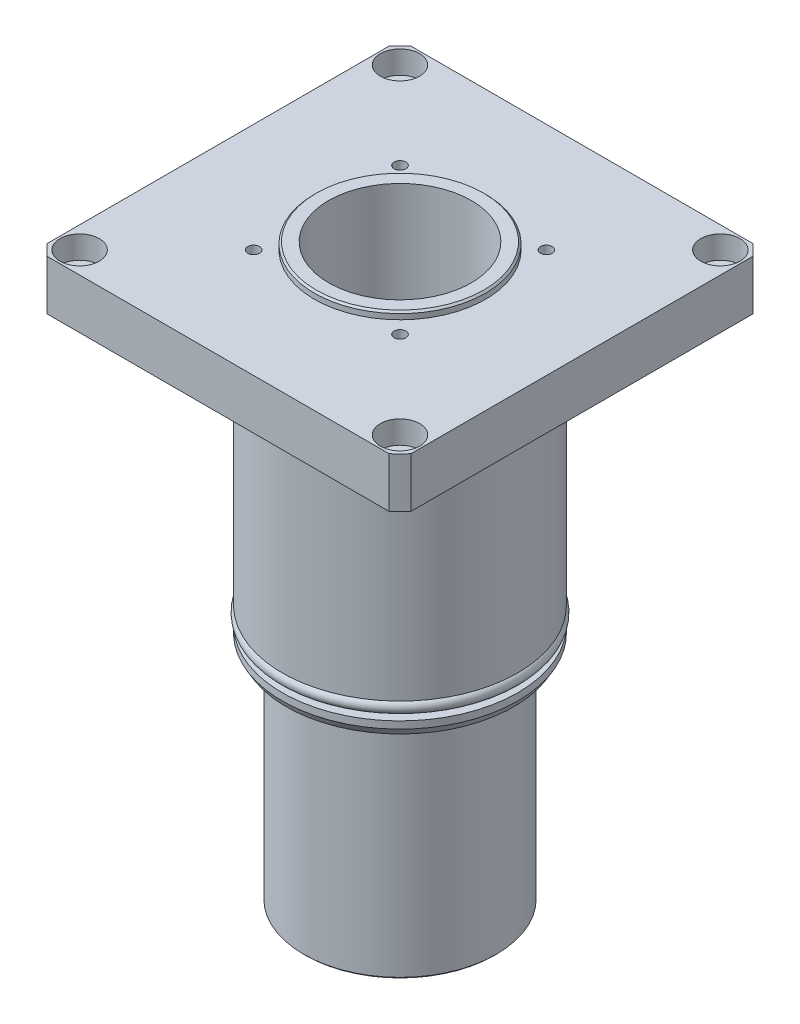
ISO-10303-21;
HEADER;
FILE_DESCRIPTION(('STEP AP214'),'2;1');
FILE_NAME('part.step','',(''),(''),'','','');
FILE_SCHEMA(('AUTOMOTIVE_DESIGN { 1 0 10303 214 1 1 1 1 }'));
ENDSEC;
DATA;
#1=APPLICATION_CONTEXT('core data for automotive mechanical design processes');
#2=APPLICATION_PROTOCOL_DEFINITION('international standard','automotive_design',2000,#1);
#3=PRODUCT_CONTEXT('',#1,'mechanical');
#4=PRODUCT('Part','Part','',(#3));
#5=PRODUCT_RELATED_PRODUCT_CATEGORY('part','',(#4));
#6=PRODUCT_DEFINITION_FORMATION('','',#4);
#7=PRODUCT_DEFINITION_CONTEXT('part definition',#1,'design');
#8=PRODUCT_DEFINITION('design','',#6,#7);
#9=PRODUCT_DEFINITION_SHAPE('','',#8);
#10=(LENGTH_UNIT() NAMED_UNIT(*) SI_UNIT(.MILLI.,.METRE.));
#11=(NAMED_UNIT(*) PLANE_ANGLE_UNIT() SI_UNIT($,.RADIAN.));
#12=(NAMED_UNIT(*) SI_UNIT($,.STERADIAN.) SOLID_ANGLE_UNIT());
#13=UNCERTAINTY_MEASURE_WITH_UNIT(LENGTH_MEASURE(1.E-05),#10,'distance_accuracy_value','');
#14=(GEOMETRIC_REPRESENTATION_CONTEXT(3) GLOBAL_UNCERTAINTY_ASSIGNED_CONTEXT((#13)) GLOBAL_UNIT_ASSIGNED_CONTEXT((#10,
#11,#12)) REPRESENTATION_CONTEXT('',''));
#15=CARTESIAN_POINT('',(0.,0.,0.));
#16=DIRECTION('',(0.,0.,1.));
#17=DIRECTION('',(1.,0.,0.));
#18=AXIS2_PLACEMENT_3D('',#15,#16,#17);
#19=CARTESIAN_POINT('',(0.,7.03500000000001,0.));
#20=DIRECTION('',(0.,1.,0.));
#21=DIRECTION('',(-1.,0.,0.));
#22=AXIS2_PLACEMENT_3D('',#19,#20,#21);
#23=TOROIDAL_SURFACE('',#22,31.725,1.76500000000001);
#24=CARTESIAN_POINT('',(-33.49,7.03500000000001,0.));
#25=VERTEX_POINT('',#24);
#26=VERTEX_LOOP('',#25);
#27=FACE_BOUND('',#26,.T.);
#28=ADVANCED_FACE('F44',(#27),#23,.T.);
#29=CLOSED_SHELL('',(#28));
#30=MANIFOLD_SOLID_BREP('B2',#29);
#31=CARTESIAN_POINT('',(70.,95.,0.));
#32=DIRECTION('',(0.,-1.,0.));
#33=DIRECTION('',(1.,0.,0.));
#34=AXIS2_PLACEMENT_3D('',#31,#32,#33);
#35=PLANE('',#34);
#36=CARTESIAN_POINT('',(20.5060966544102,95.,20.5060966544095));
#37=DIRECTION('',(0.,1.,0.));
#38=DIRECTION('',(0.,0.,1.));
#39=AXIS2_PLACEMENT_3D('',#36,#37,#38);
#40=CIRCLE('',#39,1.64999999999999);
#41=CARTESIAN_POINT('',(20.5060966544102,95.,22.1560966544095));
#42=VERTEX_POINT('',#41);
#43=EDGE_CURVE('E141',#42,#42,#40,.T.);
#44=ORIENTED_EDGE('',*,*,#43,.F.);
#45=EDGE_LOOP('',(#44));
#46=FACE_BOUND('',#45,.T.);
#47=CARTESIAN_POINT('',(-20.5060966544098,95.,20.50609665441));
#48=DIRECTION('',(0.,1.,0.));
#49=DIRECTION('',(0.,0.,1.));
#50=AXIS2_PLACEMENT_3D('',#47,#48,#49);
#51=CIRCLE('',#50,1.64999999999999);
#52=CARTESIAN_POINT('',(-20.5060966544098,95.,22.15609665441));
#53=VERTEX_POINT('',#52);
#54=EDGE_CURVE('E140',#53,#53,#51,.T.);
#55=ORIENTED_EDGE('',*,*,#54,.F.);
#56=EDGE_LOOP('',(#55));
#57=FACE_BOUND('',#56,.T.);
#58=CARTESIAN_POINT('',(-20.5060966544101,95.,-20.5060966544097));
#59=DIRECTION('',(0.,1.,0.));
#60=DIRECTION('',(0.,0.,1.));
#61=AXIS2_PLACEMENT_3D('',#58,#59,#60);
#62=CIRCLE('',#61,1.64999999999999);
#63=CARTESIAN_POINT('',(-20.5060966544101,95.,-18.8560966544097));
#64=VERTEX_POINT('',#63);
#65=EDGE_CURVE('E151',#64,#64,#62,.T.);
#66=ORIENTED_EDGE('',*,*,#65,.F.);
#67=EDGE_LOOP('',(#66));
#68=FACE_BOUND('',#67,.T.);
#69=CARTESIAN_POINT('',(20.5060966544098,95.,-20.50609665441));
#70=DIRECTION('',(0.,1.,0.));
#71=DIRECTION('',(0.,0.,1.));
#72=AXIS2_PLACEMENT_3D('',#69,#70,#71);
#73=CIRCLE('',#72,1.64999999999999);
#74=CARTESIAN_POINT('',(20.5060966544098,95.,-18.85609665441));
#75=VERTEX_POINT('',#74);
#76=EDGE_CURVE('E157',#75,#75,#73,.T.);
#77=ORIENTED_EDGE('',*,*,#76,.F.);
#78=EDGE_LOOP('',(#77));
#79=FACE_BOUND('',#78,.T.);
#80=CARTESIAN_POINT('',(-44.9012806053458,95.,44.9012806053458));
#81=DIRECTION('',(0.,1.,0.));
#82=DIRECTION('',(0.,0.,1.));
#83=AXIS2_PLACEMENT_3D('',#80,#81,#82);
#84=CIRCLE('',#83,5.49999999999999);
#85=CARTESIAN_POINT('',(-44.9012806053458,95.,50.4012806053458));
#86=VERTEX_POINT('',#85);
#87=EDGE_CURVE('E163',#86,#86,#84,.T.);
#88=ORIENTED_EDGE('',*,*,#87,.F.);
#89=EDGE_LOOP('',(#88));
#90=FACE_BOUND('',#89,.T.);
#91=CARTESIAN_POINT('',(-44.9012806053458,95.,-44.9012806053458));
#92=DIRECTION('',(0.,1.,0.));
#93=DIRECTION('',(0.,0.,1.));
#94=AXIS2_PLACEMENT_3D('',#91,#92,#93);
#95=CIRCLE('',#94,5.49999999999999);
#96=CARTESIAN_POINT('',(-44.9012806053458,95.,-39.4012806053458));
#97=VERTEX_POINT('',#96);
#98=EDGE_CURVE('E173',#97,#97,#95,.T.);
#99=ORIENTED_EDGE('',*,*,#98,.F.);
#100=EDGE_LOOP('',(#99));
#101=FACE_BOUND('',#100,.T.);
#102=CARTESIAN_POINT('',(44.9012806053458,95.,-44.9012806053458));
#103=DIRECTION('',(0.,1.,0.));
#104=DIRECTION('',(0.,0.,1.));
#105=AXIS2_PLACEMENT_3D('',#102,#103,#104);
#106=CIRCLE('',#105,5.49999999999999);
#107=CARTESIAN_POINT('',(44.9012806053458,95.,-39.4012806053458));
#108=VERTEX_POINT('',#107);
#109=EDGE_CURVE('E183',#108,#108,#106,.T.);
#110=ORIENTED_EDGE('',*,*,#109,.F.);
#111=EDGE_LOOP('',(#110));
#112=FACE_BOUND('',#111,.T.);
#113=CARTESIAN_POINT('',(44.9012806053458,95.,44.9012806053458));
#114=DIRECTION('',(0.,1.,0.));
#115=DIRECTION('',(0.,0.,1.));
#116=AXIS2_PLACEMENT_3D('',#113,#114,#115);
#117=CIRCLE('',#116,5.49999999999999);
#118=CARTESIAN_POINT('',(44.9012806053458,95.,50.4012806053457));
#119=VERTEX_POINT('',#118);
#120=EDGE_CURVE('E193',#119,#119,#117,.T.);
#121=ORIENTED_EDGE('',*,*,#120,.F.);
#122=EDGE_LOOP('',(#121));
#123=FACE_BOUND('',#122,.T.);
#124=CARTESIAN_POINT('',(0.,95.,0.));
#125=DIRECTION('',(0.,1.,0.));
#126=DIRECTION('',(-1.,0.,0.));
#127=AXIS2_PLACEMENT_3D('',#124,#125,#126);
#128=CIRCLE('',#127,24.);
#129=CARTESIAN_POINT('',(-24.,95.,0.));
#130=VERTEX_POINT('',#129);
#131=EDGE_CURVE('E241',#130,#130,#128,.T.);
#132=ORIENTED_EDGE('',*,*,#131,.F.);
#133=EDGE_LOOP('',(#132));
#134=FACE_BOUND('',#133,.T.);
#135=DIRECTION('',(0.,0.,-1.));
#136=VECTOR('',#135,1.);
#137=CARTESIAN_POINT('',(51.,95.,-51.));
#138=LINE('',#137,#136);
#139=CARTESIAN_POINT('',(51.,95.,47.9478883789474));
#140=VERTEX_POINT('',#139);
#141=CARTESIAN_POINT('',(51.,95.,-47.9478883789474));
#142=VERTEX_POINT('',#141);
#143=EDGE_CURVE('E203',#140,#142,#138,.T.);
#144=ORIENTED_EDGE('',*,*,#143,.T.);
#145=CARTESIAN_POINT('',(0.,95.,0.));
#146=DIRECTION('',(0.,1.,0.));
#147=DIRECTION('',(-1.,0.,0.));
#148=AXIS2_PLACEMENT_3D('',#145,#146,#147);
#149=CIRCLE('',#148,70.);
#150=CARTESIAN_POINT('',(47.9478883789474,95.,-51.));
#151=VERTEX_POINT('',#150);
#152=EDGE_CURVE('E470',#142,#151,#149,.T.);
#153=ORIENTED_EDGE('',*,*,#152,.T.);
#154=DIRECTION('',(-1.,0.,0.));
#155=VECTOR('',#154,1.);
#156=CARTESIAN_POINT('',(-51.,95.,-51.));
#157=LINE('',#156,#155);
#158=CARTESIAN_POINT('',(-47.9478883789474,95.,-51.));
#159=VERTEX_POINT('',#158);
#160=EDGE_CURVE('E206',#151,#159,#157,.T.);
#161=ORIENTED_EDGE('',*,*,#160,.T.);
#162=CARTESIAN_POINT('',(-51.,95.,-47.9478883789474));
#163=VERTEX_POINT('',#162);
#164=EDGE_CURVE('E236',#159,#163,#149,.T.);
#165=ORIENTED_EDGE('',*,*,#164,.T.);
#166=DIRECTION('',(0.,0.,1.));
#167=VECTOR('',#166,1.);
#168=CARTESIAN_POINT('',(-51.,95.,-51.));
#169=LINE('',#168,#167);
#170=CARTESIAN_POINT('',(-51.,95.,47.9478883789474));
#171=VERTEX_POINT('',#170);
#172=EDGE_CURVE('E209',#163,#171,#169,.T.);
#173=ORIENTED_EDGE('',*,*,#172,.T.);
#174=CARTESIAN_POINT('',(-47.9478883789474,95.,51.));
#175=VERTEX_POINT('',#174);
#176=EDGE_CURVE('E238',#171,#175,#149,.T.);
#177=ORIENTED_EDGE('',*,*,#176,.T.);
#178=DIRECTION('',(1.,0.,0.));
#179=VECTOR('',#178,1.);
#180=CARTESIAN_POINT('',(-51.,95.,51.));
#181=LINE('',#180,#179);
#182=CARTESIAN_POINT('',(47.9478883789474,95.,51.));
#183=VERTEX_POINT('',#182);
#184=EDGE_CURVE('E212',#175,#183,#181,.T.);
#185=ORIENTED_EDGE('',*,*,#184,.T.);
#186=EDGE_CURVE('E242',#183,#140,#149,.T.);
#187=ORIENTED_EDGE('',*,*,#186,.T.);
#188=EDGE_LOOP('',(#144,#153,#161,#165,#173,#177,#185,#187));
#189=FACE_BOUND('',#188,.T.);
#190=ADVANCED_FACE('F55',(#46,#57,#68,#79,#90,#101,#112,#123,#134,#189),#35,.F.);
#191=CARTESIAN_POINT('',(0.,129.496151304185,0.));
#192=DIRECTION('',(0.,1.,0.));
#193=DIRECTION('',(-1.,0.,0.));
#194=AXIS2_PLACEMENT_3D('',#191,#192,#193);
#195=CYLINDRICAL_SURFACE('',#194,70.);
#196=DIRECTION('',(0.,1.,0.));
#197=VECTOR('',#196,1.);
#198=CARTESIAN_POINT('',(51.,129.496151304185,-47.9478883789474));
#199=LINE('',#198,#197);
#200=CARTESIAN_POINT('',(51.,81.,-47.9478883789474));
#201=VERTEX_POINT('',#200);
#202=EDGE_CURVE('E227',#201,#142,#199,.T.);
#203=ORIENTED_EDGE('',*,*,#202,.F.);
#204=CARTESIAN_POINT('',(0.,81.,0.));
#205=DIRECTION('',(0.,1.,0.));
#206=DIRECTION('',(-1.,0.,0.));
#207=AXIS2_PLACEMENT_3D('',#204,#205,#206);
#208=CIRCLE('',#207,70.);
#209=CARTESIAN_POINT('',(47.9478883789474,81.,-51.));
#210=VERTEX_POINT('',#209);
#211=EDGE_CURVE('E451',#201,#210,#208,.T.);
#212=ORIENTED_EDGE('',*,*,#211,.T.);
#213=DIRECTION('',(0.,1.,0.));
#214=VECTOR('',#213,1.);
#215=CARTESIAN_POINT('',(47.9478883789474,129.496151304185,-51.));
#216=LINE('',#215,#214);
#217=EDGE_CURVE('E78',#151,#210,#216,.F.);
#218=ORIENTED_EDGE('',*,*,#217,.F.);
#219=ORIENTED_EDGE('',*,*,#152,.F.);
#220=EDGE_LOOP('',(#203,#212,#218,#219));
#221=FACE_BOUND('',#220,.T.);
#222=ADVANCED_FACE('F324',(#221),#195,.T.);
#223=DIRECTION('',(0.,1.,0.));
#224=VECTOR('',#223,1.);
#225=CARTESIAN_POINT('',(51.,129.496151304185,47.9478883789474));
#226=LINE('',#225,#224);
#227=CARTESIAN_POINT('',(51.,81.,47.9478883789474));
#228=VERTEX_POINT('',#227);
#229=EDGE_CURVE('E225',#140,#228,#226,.F.);
#230=ORIENTED_EDGE('',*,*,#229,.F.);
#231=ORIENTED_EDGE('',*,*,#186,.F.);
#232=DIRECTION('',(0.,1.,0.));
#233=VECTOR('',#232,1.);
#234=CARTESIAN_POINT('',(47.9478883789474,129.496151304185,51.));
#235=LINE('',#234,#233);
#236=CARTESIAN_POINT('',(47.9478883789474,81.,51.));
#237=VERTEX_POINT('',#236);
#238=EDGE_CURVE('E223',#237,#183,#235,.T.);
#239=ORIENTED_EDGE('',*,*,#238,.F.);
#240=EDGE_CURVE('E237',#237,#228,#208,.T.);
#241=ORIENTED_EDGE('',*,*,#240,.T.);
#242=EDGE_LOOP('',(#230,#231,#239,#241));
#243=FACE_BOUND('',#242,.T.);
#244=ADVANCED_FACE('F330',(#243),#195,.T.);
#245=DIRECTION('',(0.,1.,0.));
#246=VECTOR('',#245,1.);
#247=CARTESIAN_POINT('',(-47.9478883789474,129.496151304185,51.));
#248=LINE('',#247,#246);
#249=CARTESIAN_POINT('',(-47.9478883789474,81.,51.));
#250=VERTEX_POINT('',#249);
#251=EDGE_CURVE('E221',#175,#250,#248,.F.);
#252=ORIENTED_EDGE('',*,*,#251,.F.);
#253=ORIENTED_EDGE('',*,*,#176,.F.);
#254=DIRECTION('',(0.,1.,0.));
#255=VECTOR('',#254,1.);
#256=CARTESIAN_POINT('',(-51.,129.496151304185,47.9478883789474));
#257=LINE('',#256,#255);
#258=CARTESIAN_POINT('',(-51.,81.,47.9478883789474));
#259=VERTEX_POINT('',#258);
#260=EDGE_CURVE('E219',#259,#171,#257,.T.);
#261=ORIENTED_EDGE('',*,*,#260,.F.);
#262=EDGE_CURVE('E233',#259,#250,#208,.T.);
#263=ORIENTED_EDGE('',*,*,#262,.T.);
#264=EDGE_LOOP('',(#252,#253,#261,#263));
#265=FACE_BOUND('',#264,.T.);
#266=ADVANCED_FACE('F433',(#265),#195,.T.);
#267=DIRECTION('',(0.,1.,0.));
#268=VECTOR('',#267,1.);
#269=CARTESIAN_POINT('',(-51.,129.496151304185,-47.9478883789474));
#270=LINE('',#269,#268);
#271=CARTESIAN_POINT('',(-51.,81.,-47.9478883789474));
#272=VERTEX_POINT('',#271);
#273=EDGE_CURVE('E70',#163,#272,#270,.F.);
#274=ORIENTED_EDGE('',*,*,#273,.F.);
#275=ORIENTED_EDGE('',*,*,#164,.F.);
#276=DIRECTION('',(0.,1.,0.));
#277=VECTOR('',#276,1.);
#278=CARTESIAN_POINT('',(-47.9478883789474,129.496151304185,-51.));
#279=LINE('',#278,#277);
#280=CARTESIAN_POINT('',(-47.9478883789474,81.,-51.));
#281=VERTEX_POINT('',#280);
#282=EDGE_CURVE('E216',#281,#159,#279,.T.);
#283=ORIENTED_EDGE('',*,*,#282,.F.);
#284=EDGE_CURVE('E232',#281,#272,#208,.T.);
#285=ORIENTED_EDGE('',*,*,#284,.T.);
#286=EDGE_LOOP('',(#274,#275,#283,#285));
#287=FACE_BOUND('',#286,.T.);
#288=ADVANCED_FACE('F333',(#287),#195,.T.);
#289=CARTESIAN_POINT('',(36.25,81.,0.));
#290=DIRECTION('',(0.,1.,0.));
#291=DIRECTION('',(-1.,0.,0.));
#292=AXIS2_PLACEMENT_3D('',#289,#290,#291);
#293=PLANE('',#292);
#294=CARTESIAN_POINT('',(-44.9012806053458,81.,44.9012806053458));
#295=DIRECTION('',(0.,1.,0.));
#296=DIRECTION('',(-1.,0.,0.));
#297=AXIS2_PLACEMENT_3D('',#294,#295,#296);
#298=CIRCLE('',#297,3.29999999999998);
#299=CARTESIAN_POINT('',(-48.2012806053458,81.,44.9012806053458));
#300=VERTEX_POINT('',#299);
#301=EDGE_CURVE('E172',#300,#300,#298,.T.);
#302=ORIENTED_EDGE('',*,*,#301,.T.);
#303=EDGE_LOOP('',(#302));
#304=FACE_BOUND('',#303,.T.);
#305=CARTESIAN_POINT('',(-44.9012806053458,81.,-44.9012806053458));
#306=DIRECTION('',(0.,1.,0.));
#307=DIRECTION('',(-1.,0.,0.));
#308=AXIS2_PLACEMENT_3D('',#305,#306,#307);
#309=CIRCLE('',#308,3.29999999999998);
#310=CARTESIAN_POINT('',(-48.2012806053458,81.,-44.9012806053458));
#311=VERTEX_POINT('',#310);
#312=EDGE_CURVE('E182',#311,#311,#309,.T.);
#313=ORIENTED_EDGE('',*,*,#312,.T.);
#314=EDGE_LOOP('',(#313));
#315=FACE_BOUND('',#314,.T.);
#316=CARTESIAN_POINT('',(44.9012806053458,81.,-44.9012806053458));
#317=DIRECTION('',(0.,1.,0.));
#318=DIRECTION('',(-1.,0.,0.));
#319=AXIS2_PLACEMENT_3D('',#316,#317,#318);
#320=CIRCLE('',#319,3.29999999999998);
#321=CARTESIAN_POINT('',(41.6012806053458,81.,-44.9012806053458));
#322=VERTEX_POINT('',#321);
#323=EDGE_CURVE('E192',#322,#322,#320,.T.);
#324=ORIENTED_EDGE('',*,*,#323,.T.);
#325=EDGE_LOOP('',(#324));
#326=FACE_BOUND('',#325,.T.);
#327=CARTESIAN_POINT('',(44.9012806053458,81.,44.9012806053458));
#328=DIRECTION('',(0.,1.,0.));
#329=DIRECTION('',(-1.,0.,0.));
#330=AXIS2_PLACEMENT_3D('',#327,#328,#329);
#331=CIRCLE('',#330,3.29999999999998);
#332=CARTESIAN_POINT('',(41.6012806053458,81.,44.9012806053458));
#333=VERTEX_POINT('',#332);
#334=EDGE_CURVE('E202',#333,#333,#331,.T.);
#335=ORIENTED_EDGE('',*,*,#334,.T.);
#336=EDGE_LOOP('',(#335));
#337=FACE_BOUND('',#336,.T.);
#338=CARTESIAN_POINT('',(0.,81.,0.));
#339=DIRECTION('',(0.,1.,0.));
#340=DIRECTION('',(-1.,0.,0.));
#341=AXIS2_PLACEMENT_3D('',#338,#339,#340);
#342=CIRCLE('',#341,36.25);
#343=CARTESIAN_POINT('',(-36.25,81.,0.));
#344=VERTEX_POINT('',#343);
#345=EDGE_CURVE('E229',#344,#344,#342,.T.);
#346=ORIENTED_EDGE('',*,*,#345,.T.);
#347=EDGE_LOOP('',(#346));
#348=FACE_BOUND('',#347,.T.);
#349=DIRECTION('',(0.,0.,-1.));
#350=VECTOR('',#349,1.);
#351=CARTESIAN_POINT('',(51.,81.,0.));
#352=LINE('',#351,#350);
#353=EDGE_CURVE('E293',#228,#201,#352,.T.);
#354=ORIENTED_EDGE('',*,*,#353,.F.);
#355=ORIENTED_EDGE('',*,*,#240,.F.);
#356=DIRECTION('',(1.,0.,0.));
#357=VECTOR('',#356,1.);
#358=CARTESIAN_POINT('',(36.25,81.,51.));
#359=LINE('',#358,#357);
#360=EDGE_CURVE('E291',#250,#237,#359,.T.);
#361=ORIENTED_EDGE('',*,*,#360,.F.);
#362=ORIENTED_EDGE('',*,*,#262,.F.);
#363=DIRECTION('',(0.,0.,1.));
#364=VECTOR('',#363,1.);
#365=CARTESIAN_POINT('',(-51.,81.,0.));
#366=LINE('',#365,#364);
#367=EDGE_CURVE('E289',#272,#259,#366,.T.);
#368=ORIENTED_EDGE('',*,*,#367,.F.);
#369=ORIENTED_EDGE('',*,*,#284,.F.);
#370=DIRECTION('',(-1.,0.,0.));
#371=VECTOR('',#370,1.);
#372=CARTESIAN_POINT('',(36.25,81.,-51.));
#373=LINE('',#372,#371);
#374=EDGE_CURVE('E287',#210,#281,#373,.T.);
#375=ORIENTED_EDGE('',*,*,#374,.F.);
#376=ORIENTED_EDGE('',*,*,#211,.F.);
#377=EDGE_LOOP('',(#354,#355,#361,#362,#368,#369,#375,#376));
#378=FACE_BOUND('',#377,.T.);
#379=ADVANCED_FACE('F395',(#304,#315,#326,#337,#348,#378),#293,.F.);
#380=CARTESIAN_POINT('',(0.,129.496151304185,0.));
#381=DIRECTION('',(0.,1.,0.));
#382=DIRECTION('',(-1.,0.,0.));
#383=AXIS2_PLACEMENT_3D('',#380,#381,#382);
#384=CYLINDRICAL_SURFACE('',#383,36.25);
#385=ORIENTED_EDGE('',*,*,#345,.F.);
#386=EDGE_LOOP('',(#385));
#387=FACE_BOUND('',#386,.T.);
#388=CARTESIAN_POINT('',(0.,71.,0.));
#389=DIRECTION('',(0.,1.,0.));
#390=DIRECTION('',(-1.,0.,0.));
#391=AXIS2_PLACEMENT_3D('',#388,#389,#390);
#392=CIRCLE('',#391,36.25);
#393=CARTESIAN_POINT('',(-36.25,71.,0.));
#394=VERTEX_POINT('',#393);
#395=EDGE_CURVE('E278',#394,#394,#392,.T.);
#396=ORIENTED_EDGE('',*,*,#395,.T.);
#397=EDGE_LOOP('',(#396));
#398=FACE_BOUND('',#397,.T.);
#399=ADVANCED_FACE('F392',(#387,#398),#384,.T.);
#400=CARTESIAN_POINT('',(0.,65.3708348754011,0.));
#401=DIRECTION('',(0.,1.,0.));
#402=DIRECTION('',(-1.,0.,0.));
#403=AXIS2_PLACEMENT_3D('',#400,#401,#402);
#404=CONICAL_SURFACE('',#403,33.,0.523598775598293);
#405=ORIENTED_EDGE('',*,*,#395,.F.);
#406=EDGE_LOOP('',(#405));
#407=FACE_BOUND('',#406,.T.);
#408=CARTESIAN_POINT('',(0.,65.3708348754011,0.));
#409=DIRECTION('',(0.,1.,0.));
#410=DIRECTION('',(-1.,0.,0.));
#411=AXIS2_PLACEMENT_3D('',#408,#409,#410);
#412=CIRCLE('',#411,33.);
#413=CARTESIAN_POINT('',(-33.,65.3708348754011,0.));
#414=VERTEX_POINT('',#413);
#415=EDGE_CURVE('E275',#414,#414,#412,.T.);
#416=ORIENTED_EDGE('',*,*,#415,.T.);
#417=EDGE_LOOP('',(#416));
#418=FACE_BOUND('',#417,.T.);
#419=ADVANCED_FACE('F388',(#407,#418),#404,.T.);
#420=CARTESIAN_POINT('',(0.,129.496151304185,0.));
#421=DIRECTION('',(0.,1.,0.));
#422=DIRECTION('',(-1.,0.,0.));
#423=AXIS2_PLACEMENT_3D('',#420,#421,#422);
#424=CYLINDRICAL_SURFACE('',#423,33.);
#425=ORIENTED_EDGE('',*,*,#415,.F.);
#426=EDGE_LOOP('',(#425));
#427=FACE_BOUND('',#426,.T.);
#428=CARTESIAN_POINT('',(0.,8.80000000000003,0.));
#429=DIRECTION('',(0.,1.,0.));
#430=DIRECTION('',(-1.,0.,0.));
#431=AXIS2_PLACEMENT_3D('',#428,#429,#430);
#432=CIRCLE('',#431,33.);
#433=CARTESIAN_POINT('',(-33.,8.80000000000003,0.));
#434=VERTEX_POINT('',#433);
#435=EDGE_CURVE('E272',#434,#434,#432,.T.);
#436=ORIENTED_EDGE('',*,*,#435,.T.);
#437=EDGE_LOOP('',(#436));
#438=FACE_BOUND('',#437,.T.);
#439=ADVANCED_FACE('F384',(#427,#438),#424,.T.);
#440=CARTESIAN_POINT('',(33.,8.79999999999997,0.));
#441=DIRECTION('',(0.,1.,0.));
#442=DIRECTION('',(-1.,0.,0.));
#443=AXIS2_PLACEMENT_3D('',#440,#441,#442);
#444=PLANE('',#443);
#445=ORIENTED_EDGE('',*,*,#435,.F.);
#446=EDGE_LOOP('',(#445));
#447=FACE_BOUND('',#446,.T.);
#448=CARTESIAN_POINT('',(0.,8.80000000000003,0.));
#449=DIRECTION('',(0.,1.,0.));
#450=DIRECTION('',(-1.,0.,0.));
#451=AXIS2_PLACEMENT_3D('',#448,#449,#450);
#452=CIRCLE('',#451,30.);
#453=CARTESIAN_POINT('',(-30.,8.80000000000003,0.));
#454=VERTEX_POINT('',#453);
#455=EDGE_CURVE('E269',#454,#454,#452,.T.);
#456=ORIENTED_EDGE('',*,*,#455,.T.);
#457=EDGE_LOOP('',(#456));
#458=FACE_BOUND('',#457,.T.);
#459=ADVANCED_FACE('F380',(#447,#458),#444,.F.);
#460=CARTESIAN_POINT('',(0.,129.496151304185,0.));
#461=DIRECTION('',(0.,1.,0.));
#462=DIRECTION('',(-1.,0.,0.));
#463=AXIS2_PLACEMENT_3D('',#460,#461,#462);
#464=CYLINDRICAL_SURFACE('',#463,30.);
#465=ORIENTED_EDGE('',*,*,#455,.F.);
#466=EDGE_LOOP('',(#465));
#467=FACE_BOUND('',#466,.T.);
#468=CARTESIAN_POINT('',(0.,4.,0.));
#469=DIRECTION('',(0.,1.,0.));
#470=DIRECTION('',(-1.,0.,0.));
#471=AXIS2_PLACEMENT_3D('',#468,#469,#470);
#472=CIRCLE('',#471,30.);
#473=CARTESIAN_POINT('',(-30.,4.,0.));
#474=VERTEX_POINT('',#473);
#475=EDGE_CURVE('E266',#474,#474,#472,.T.);
#476=ORIENTED_EDGE('',*,*,#475,.T.);
#477=EDGE_LOOP('',(#476));
#478=FACE_BOUND('',#477,.T.);
#479=ADVANCED_FACE('F376',(#467,#478),#464,.T.);
#480=CARTESIAN_POINT('',(30.,4.,0.));
#481=DIRECTION('',(0.,-1.,0.));
#482=DIRECTION('',(1.,0.,0.));
#483=AXIS2_PLACEMENT_3D('',#480,#481,#482);
#484=PLANE('',#483);
#485=ORIENTED_EDGE('',*,*,#475,.F.);
#486=EDGE_LOOP('',(#485));
#487=FACE_BOUND('',#486,.T.);
#488=CARTESIAN_POINT('',(0.,4.,0.));
#489=DIRECTION('',(0.,1.,0.));
#490=DIRECTION('',(-1.,0.,0.));
#491=AXIS2_PLACEMENT_3D('',#488,#489,#490);
#492=CIRCLE('',#491,33.);
#493=CARTESIAN_POINT('',(-33.,4.,0.));
#494=VERTEX_POINT('',#493);
#495=EDGE_CURVE('E263',#494,#494,#492,.T.);
#496=ORIENTED_EDGE('',*,*,#495,.T.);
#497=EDGE_LOOP('',(#496));
#498=FACE_BOUND('',#497,.T.);
#499=ADVANCED_FACE('F372',(#487,#498),#484,.F.);
#500=CARTESIAN_POINT('',(0.,129.496151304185,0.));
#501=DIRECTION('',(0.,1.,0.));
#502=DIRECTION('',(-1.,0.,0.));
#503=AXIS2_PLACEMENT_3D('',#500,#501,#502);
#504=CYLINDRICAL_SURFACE('',#503,33.);
#505=ORIENTED_EDGE('',*,*,#495,.F.);
#506=EDGE_LOOP('',(#505));
#507=FACE_BOUND('',#506,.T.);
#508=CARTESIAN_POINT('',(0.,2.,0.));
#509=DIRECTION('',(0.,1.,0.));
#510=DIRECTION('',(-1.,0.,0.));
#511=AXIS2_PLACEMENT_3D('',#508,#509,#510);
#512=CIRCLE('',#511,33.);
#513=CARTESIAN_POINT('',(-33.,2.,0.));
#514=VERTEX_POINT('',#513);
#515=EDGE_CURVE('E260',#514,#514,#512,.T.);
#516=ORIENTED_EDGE('',*,*,#515,.T.);
#517=EDGE_LOOP('',(#516));
#518=FACE_BOUND('',#517,.T.);
#519=ADVANCED_FACE('F368',(#507,#518),#504,.T.);
#520=CARTESIAN_POINT('',(0.,0.,0.));
#521=DIRECTION('',(0.,1.,0.));
#522=DIRECTION('',(-1.,0.,0.));
#523=AXIS2_PLACEMENT_3D('',#520,#521,#522);
#524=CONICAL_SURFACE('',#523,31.8452994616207,0.523598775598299);
#525=ORIENTED_EDGE('',*,*,#515,.F.);
#526=EDGE_LOOP('',(#525));
#527=FACE_BOUND('',#526,.T.);
#528=CARTESIAN_POINT('',(0.,0.,0.));
#529=DIRECTION('',(0.,1.,0.));
#530=DIRECTION('',(-1.,0.,0.));
#531=AXIS2_PLACEMENT_3D('',#528,#529,#530);
#532=CIRCLE('',#531,31.8452994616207);
#533=CARTESIAN_POINT('',(-31.8452994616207,0.,0.));
#534=VERTEX_POINT('',#533);
#535=EDGE_CURVE('E257',#534,#534,#532,.T.);
#536=ORIENTED_EDGE('',*,*,#535,.T.);
#537=EDGE_LOOP('',(#536));
#538=FACE_BOUND('',#537,.T.);
#539=ADVANCED_FACE('F364',(#527,#538),#524,.T.);
#540=CARTESIAN_POINT('',(27.,0.,0.));
#541=DIRECTION('',(0.,1.,0.));
#542=DIRECTION('',(-1.,0.,0.));
#543=AXIS2_PLACEMENT_3D('',#540,#541,#542);
#544=PLANE('',#543);
#545=ORIENTED_EDGE('',*,*,#535,.F.);
#546=EDGE_LOOP('',(#545));
#547=FACE_BOUND('',#546,.T.);
#548=CARTESIAN_POINT('',(0.,0.,0.));
#549=DIRECTION('',(0.,1.,0.));
#550=DIRECTION('',(-1.,0.,0.));
#551=AXIS2_PLACEMENT_3D('',#548,#549,#550);
#552=CIRCLE('',#551,27.);
#553=CARTESIAN_POINT('',(-27.,0.,0.));
#554=VERTEX_POINT('',#553);
#555=EDGE_CURVE('E254',#554,#554,#552,.T.);
#556=ORIENTED_EDGE('',*,*,#555,.T.);
#557=EDGE_LOOP('',(#556));
#558=FACE_BOUND('',#557,.T.);
#559=ADVANCED_FACE('F360',(#547,#558),#544,.F.);
#560=CARTESIAN_POINT('',(0.,129.496151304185,0.));
#561=DIRECTION('',(0.,1.,0.));
#562=DIRECTION('',(-1.,0.,0.));
#563=AXIS2_PLACEMENT_3D('',#560,#561,#562);
#564=CYLINDRICAL_SURFACE('',#563,27.);
#565=CARTESIAN_POINT('',(0.,-62.4999999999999,0.));
#566=DIRECTION('',(0.,1.,0.));
#567=DIRECTION('',(-1.,0.,0.));
#568=AXIS2_PLACEMENT_3D('',#565,#566,#567);
#569=CIRCLE('',#568,27.);
#570=CARTESIAN_POINT('',(-27.,-62.4999999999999,0.));
#571=VERTEX_POINT('',#570);
#572=EDGE_CURVE('E281',#571,#571,#569,.T.);
#573=ORIENTED_EDGE('',*,*,#572,.T.);
#574=EDGE_LOOP('',(#573));
#575=FACE_BOUND('',#574,.T.);
#576=ORIENTED_EDGE('',*,*,#555,.F.);
#577=EDGE_LOOP('',(#576));
#578=FACE_BOUND('',#577,.T.);
#579=ADVANCED_FACE('F356',(#575,#578),#564,.T.);
#580=CARTESIAN_POINT('',(20.8,-63.,0.));
#581=DIRECTION('',(0.,1.,0.));
#582=DIRECTION('',(-1.,0.,0.));
#583=AXIS2_PLACEMENT_3D('',#580,#581,#582);
#584=PLANE('',#583);
#585=CARTESIAN_POINT('',(0.,-63.,0.));
#586=DIRECTION('',(0.,1.,0.));
#587=DIRECTION('',(-1.,0.,0.));
#588=AXIS2_PLACEMENT_3D('',#585,#586,#587);
#589=CIRCLE('',#588,26.4999999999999);
#590=CARTESIAN_POINT('',(-26.4999999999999,-63.,0.));
#591=VERTEX_POINT('',#590);
#592=EDGE_CURVE('E284',#591,#591,#589,.F.);
#593=ORIENTED_EDGE('',*,*,#592,.T.);
#594=EDGE_LOOP('',(#593));
#595=FACE_BOUND('',#594,.T.);
#596=CARTESIAN_POINT('',(0.,-63.,0.));
#597=DIRECTION('',(0.,1.,0.));
#598=DIRECTION('',(-1.,0.,0.));
#599=AXIS2_PLACEMENT_3D('',#596,#597,#598);
#600=CIRCLE('',#599,20.8);
#601=CARTESIAN_POINT('',(-20.8,-63.,0.));
#602=VERTEX_POINT('',#601);
#603=EDGE_CURVE('E251',#602,#602,#600,.T.);
#604=ORIENTED_EDGE('',*,*,#603,.T.);
#605=EDGE_LOOP('',(#604));
#606=FACE_BOUND('',#605,.T.);
#607=ADVANCED_FACE('F352',(#595,#606),#584,.F.);
#608=CARTESIAN_POINT('',(0.,-60.8020180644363,0.));
#609=DIRECTION('',(0.,-1.,0.));
#610=DIRECTION('',(1.,0.,0.));
#611=AXIS2_PLACEMENT_3D('',#608,#609,#610);
#612=CONICAL_SURFACE('',#611,20.,0.349065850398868);
#613=ORIENTED_EDGE('',*,*,#603,.F.);
#614=EDGE_LOOP('',(#613));
#615=FACE_BOUND('',#614,.T.);
#616=CARTESIAN_POINT('',(0.,-60.8020180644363,0.));
#617=DIRECTION('',(0.,1.,0.));
#618=DIRECTION('',(-1.,0.,0.));
#619=AXIS2_PLACEMENT_3D('',#616,#617,#618);
#620=CIRCLE('',#619,20.);
#621=CARTESIAN_POINT('',(-20.,-60.8020180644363,0.));
#622=VERTEX_POINT('',#621);
#623=EDGE_CURVE('E248',#622,#622,#620,.T.);
#624=ORIENTED_EDGE('',*,*,#623,.T.);
#625=EDGE_LOOP('',(#624));
#626=FACE_BOUND('',#625,.T.);
#627=ADVANCED_FACE('F348',(#615,#626),#612,.F.);
#628=CARTESIAN_POINT('',(0.,129.496151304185,0.));
#629=DIRECTION('',(0.,1.,0.));
#630=DIRECTION('',(-1.,0.,0.));
#631=AXIS2_PLACEMENT_3D('',#628,#629,#630);
#632=CYLINDRICAL_SURFACE('',#631,20.);
#633=ORIENTED_EDGE('',*,*,#623,.F.);
#634=EDGE_LOOP('',(#633));
#635=FACE_BOUND('',#634,.T.);
#636=CARTESIAN_POINT('',(0.,97.,0.));
#637=DIRECTION('',(0.,1.,0.));
#638=DIRECTION('',(-1.,0.,0.));
#639=AXIS2_PLACEMENT_3D('',#636,#637,#638);
#640=CIRCLE('',#639,20.);
#641=CARTESIAN_POINT('',(-20.,97.,0.));
#642=VERTEX_POINT('',#641);
#643=EDGE_CURVE('E245',#642,#642,#640,.T.);
#644=ORIENTED_EDGE('',*,*,#643,.T.);
#645=EDGE_LOOP('',(#644));
#646=FACE_BOUND('',#645,.T.);
#647=ADVANCED_FACE('F345',(#635,#646),#632,.F.);
#648=CARTESIAN_POINT('',(24.,97.,0.));
#649=DIRECTION('',(0.,-1.,0.));
#650=DIRECTION('',(1.,0.,0.));
#651=AXIS2_PLACEMENT_3D('',#648,#649,#650);
#652=PLANE('',#651);
#653=CARTESIAN_POINT('',(0.,97.,0.));
#654=DIRECTION('',(0.,-1.,0.));
#655=DIRECTION('',(1.,0.,0.));
#656=AXIS2_PLACEMENT_3D('',#653,#654,#655);
#657=CIRCLE('',#656,23.5000000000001);
#658=CARTESIAN_POINT('',(23.5000000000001,97.,0.));
#659=VERTEX_POINT('',#658);
#660=EDGE_CURVE('E63',#659,#659,#657,.F.);
#661=ORIENTED_EDGE('',*,*,#660,.T.);
#662=EDGE_LOOP('',(#661));
#663=FACE_BOUND('',#662,.T.);
#664=ORIENTED_EDGE('',*,*,#643,.F.);
#665=EDGE_LOOP('',(#664));
#666=FACE_BOUND('',#665,.T.);
#667=ADVANCED_FACE('F305',(#663,#666),#652,.F.);
#668=CARTESIAN_POINT('',(0.,129.496151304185,0.));
#669=DIRECTION('',(0.,1.,0.));
#670=DIRECTION('',(-1.,0.,0.));
#671=AXIS2_PLACEMENT_3D('',#668,#669,#670);
#672=CYLINDRICAL_SURFACE('',#671,24.);
#673=CARTESIAN_POINT('',(0.,96.5000000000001,0.));
#674=DIRECTION('',(0.,-1.,0.));
#675=DIRECTION('',(1.,0.,0.));
#676=AXIS2_PLACEMENT_3D('',#673,#674,#675);
#677=CIRCLE('',#676,24.);
#678=CARTESIAN_POINT('',(24.,96.5000000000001,0.));
#679=VERTEX_POINT('',#678);
#680=EDGE_CURVE('E42',#679,#679,#677,.T.);
#681=ORIENTED_EDGE('',*,*,#680,.T.);
#682=EDGE_LOOP('',(#681));
#683=FACE_BOUND('',#682,.T.);
#684=ORIENTED_EDGE('',*,*,#131,.T.);
#685=EDGE_LOOP('',(#684));
#686=FACE_BOUND('',#685,.T.);
#687=ADVANCED_FACE('F338',(#683,#686),#672,.T.);
#688=CARTESIAN_POINT('',(0.,-62.4999999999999,0.));
#689=DIRECTION('',(0.,1.,0.));
#690=DIRECTION('',(-1.,0.,0.));
#691=AXIS2_PLACEMENT_3D('',#688,#689,#690);
#692=CONICAL_SURFACE('',#691,27.,0.785398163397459);
#693=ORIENTED_EDGE('',*,*,#592,.F.);
#694=EDGE_LOOP('',(#693));
#695=FACE_BOUND('',#694,.T.);
#696=ORIENTED_EDGE('',*,*,#572,.F.);
#697=EDGE_LOOP('',(#696));
#698=FACE_BOUND('',#697,.T.);
#699=ADVANCED_FACE('F341',(#695,#698),#692,.T.);
#700=CARTESIAN_POINT('',(-51.,65.,-51.));
#701=DIRECTION('',(0.,0.,-1.));
#702=DIRECTION('',(-1.,0.,0.));
#703=AXIS2_PLACEMENT_3D('',#700,#701,#702);
#704=PLANE('',#703);
#705=ORIENTED_EDGE('',*,*,#282,.T.);
#706=ORIENTED_EDGE('',*,*,#160,.F.);
#707=ORIENTED_EDGE('',*,*,#217,.T.);
#708=ORIENTED_EDGE('',*,*,#374,.T.);
#709=EDGE_LOOP('',(#705,#706,#707,#708));
#710=FACE_BOUND('',#709,.T.);
#711=ADVANCED_FACE('F398',(#710),#704,.T.);
#712=CARTESIAN_POINT('',(-51.,65.,-51.));
#713=DIRECTION('',(-1.,0.,0.));
#714=DIRECTION('',(0.,0.,1.));
#715=AXIS2_PLACEMENT_3D('',#712,#713,#714);
#716=PLANE('',#715);
#717=ORIENTED_EDGE('',*,*,#260,.T.);
#718=ORIENTED_EDGE('',*,*,#172,.F.);
#719=ORIENTED_EDGE('',*,*,#273,.T.);
#720=ORIENTED_EDGE('',*,*,#367,.T.);
#721=EDGE_LOOP('',(#717,#718,#719,#720));
#722=FACE_BOUND('',#721,.T.);
#723=ADVANCED_FACE('F403',(#722),#716,.T.);
#724=CARTESIAN_POINT('',(-51.,65.,51.));
#725=DIRECTION('',(0.,0.,1.));
#726=DIRECTION('',(1.,0.,0.));
#727=AXIS2_PLACEMENT_3D('',#724,#725,#726);
#728=PLANE('',#727);
#729=ORIENTED_EDGE('',*,*,#238,.T.);
#730=ORIENTED_EDGE('',*,*,#184,.F.);
#731=ORIENTED_EDGE('',*,*,#251,.T.);
#732=ORIENTED_EDGE('',*,*,#360,.T.);
#733=EDGE_LOOP('',(#729,#730,#731,#732));
#734=FACE_BOUND('',#733,.T.);
#735=ADVANCED_FACE('F420',(#734),#728,.T.);
#736=CARTESIAN_POINT('',(51.,65.,-51.));
#737=DIRECTION('',(1.,0.,0.));
#738=DIRECTION('',(0.,1.,0.));
#739=AXIS2_PLACEMENT_3D('',#736,#737,#738);
#740=PLANE('',#739);
#741=ORIENTED_EDGE('',*,*,#202,.T.);
#742=ORIENTED_EDGE('',*,*,#143,.F.);
#743=ORIENTED_EDGE('',*,*,#229,.T.);
#744=ORIENTED_EDGE('',*,*,#353,.T.);
#745=EDGE_LOOP('',(#741,#742,#743,#744));
#746=FACE_BOUND('',#745,.T.);
#747=ADVANCED_FACE('F424',(#746),#740,.T.);
#748=CARTESIAN_POINT('',(44.9012806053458,95.,44.9012806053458));
#749=DIRECTION('',(0.,1.,0.));
#750=DIRECTION('',(0.,0.,1.));
#751=AXIS2_PLACEMENT_3D('',#748,#749,#750);
#752=CYLINDRICAL_SURFACE('',#751,3.29999999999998);
#753=CARTESIAN_POINT('',(44.9012806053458,88.6,44.9012806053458));
#754=DIRECTION('',(0.,1.,0.));
#755=DIRECTION('',(0.,0.,1.));
#756=AXIS2_PLACEMENT_3D('',#753,#754,#755);
#757=CIRCLE('',#756,3.3);
#758=CARTESIAN_POINT('',(44.9012806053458,88.6,48.2012806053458));
#759=VERTEX_POINT('',#758);
#760=EDGE_CURVE('E199',#759,#759,#757,.T.);
#761=ORIENTED_EDGE('',*,*,#760,.T.);
#762=EDGE_LOOP('',(#761));
#763=FACE_BOUND('',#762,.T.);
#764=ORIENTED_EDGE('',*,*,#334,.F.);
#765=EDGE_LOOP('',(#764));
#766=FACE_BOUND('',#765,.T.);
#767=ADVANCED_FACE('F426',(#763,#766),#752,.F.);
#768=CARTESIAN_POINT('',(48.2012806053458,88.6,44.9012806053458));
#769=DIRECTION('',(0.,-1.,0.));
#770=DIRECTION('',(0.,0.,-1.));
#771=AXIS2_PLACEMENT_3D('',#768,#769,#770);
#772=PLANE('',#771);
#773=ORIENTED_EDGE('',*,*,#760,.F.);
#774=EDGE_LOOP('',(#773));
#775=FACE_BOUND('',#774,.T.);
#776=CARTESIAN_POINT('',(44.9012806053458,88.6,44.9012806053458));
#777=DIRECTION('',(0.,1.,0.));
#778=DIRECTION('',(0.,0.,1.));
#779=AXIS2_PLACEMENT_3D('',#776,#777,#778);
#780=CIRCLE('',#779,5.5);
#781=CARTESIAN_POINT('',(44.9012806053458,88.6,50.4012806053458));
#782=VERTEX_POINT('',#781);
#783=EDGE_CURVE('E196',#782,#782,#780,.T.);
#784=ORIENTED_EDGE('',*,*,#783,.T.);
#785=EDGE_LOOP('',(#784));
#786=FACE_BOUND('',#785,.T.);
#787=ADVANCED_FACE('F479',(#775,#786),#772,.F.);
#788=CARTESIAN_POINT('',(44.9012806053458,95.,44.9012806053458));
#789=DIRECTION('',(0.,1.,0.));
#790=DIRECTION('',(0.,0.,1.));
#791=AXIS2_PLACEMENT_3D('',#788,#789,#790);
#792=CYLINDRICAL_SURFACE('',#791,5.49999999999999);
#793=ORIENTED_EDGE('',*,*,#783,.F.);
#794=EDGE_LOOP('',(#793));
#795=FACE_BOUND('',#794,.T.);
#796=ORIENTED_EDGE('',*,*,#120,.T.);
#797=EDGE_LOOP('',(#796));
#798=FACE_BOUND('',#797,.T.);
#799=ADVANCED_FACE('F483',(#795,#798),#792,.F.);
#800=CARTESIAN_POINT('',(44.9012806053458,95.,-44.9012806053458));
#801=DIRECTION('',(0.,1.,0.));
#802=DIRECTION('',(0.,0.,1.));
#803=AXIS2_PLACEMENT_3D('',#800,#801,#802);
#804=CYLINDRICAL_SURFACE('',#803,3.29999999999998);
#805=CARTESIAN_POINT('',(44.9012806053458,88.6,-44.9012806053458));
#806=DIRECTION('',(0.,1.,0.));
#807=DIRECTION('',(0.,0.,1.));
#808=AXIS2_PLACEMENT_3D('',#805,#806,#807);
#809=CIRCLE('',#808,3.3);
#810=CARTESIAN_POINT('',(44.9012806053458,88.6,-41.6012806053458));
#811=VERTEX_POINT('',#810);
#812=EDGE_CURVE('E189',#811,#811,#809,.T.);
#813=ORIENTED_EDGE('',*,*,#812,.T.);
#814=EDGE_LOOP('',(#813));
#815=FACE_BOUND('',#814,.T.);
#816=ORIENTED_EDGE('',*,*,#323,.F.);
#817=EDGE_LOOP('',(#816));
#818=FACE_BOUND('',#817,.T.);
#819=ADVANCED_FACE('F487',(#815,#818),#804,.F.);
#820=CARTESIAN_POINT('',(48.2012806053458,88.6,-44.9012806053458));
#821=DIRECTION('',(0.,-1.,0.));
#822=DIRECTION('',(0.,0.,-1.));
#823=AXIS2_PLACEMENT_3D('',#820,#821,#822);
#824=PLANE('',#823);
#825=ORIENTED_EDGE('',*,*,#812,.F.);
#826=EDGE_LOOP('',(#825));
#827=FACE_BOUND('',#826,.T.);
#828=CARTESIAN_POINT('',(44.9012806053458,88.6,-44.9012806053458));
#829=DIRECTION('',(0.,1.,0.));
#830=DIRECTION('',(0.,0.,1.));
#831=AXIS2_PLACEMENT_3D('',#828,#829,#830);
#832=CIRCLE('',#831,5.5);
#833=CARTESIAN_POINT('',(44.9012806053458,88.6,-39.4012806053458));
#834=VERTEX_POINT('',#833);
#835=EDGE_CURVE('E186',#834,#834,#832,.T.);
#836=ORIENTED_EDGE('',*,*,#835,.T.);
#837=EDGE_LOOP('',(#836));
#838=FACE_BOUND('',#837,.T.);
#839=ADVANCED_FACE('F491',(#827,#838),#824,.F.);
#840=CARTESIAN_POINT('',(44.9012806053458,95.,-44.9012806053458));
#841=DIRECTION('',(0.,1.,0.));
#842=DIRECTION('',(0.,0.,1.));
#843=AXIS2_PLACEMENT_3D('',#840,#841,#842);
#844=CYLINDRICAL_SURFACE('',#843,5.49999999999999);
#845=ORIENTED_EDGE('',*,*,#835,.F.);
#846=EDGE_LOOP('',(#845));
#847=FACE_BOUND('',#846,.T.);
#848=ORIENTED_EDGE('',*,*,#109,.T.);
#849=EDGE_LOOP('',(#848));
#850=FACE_BOUND('',#849,.T.);
#851=ADVANCED_FACE('F495',(#847,#850),#844,.F.);
#852=CARTESIAN_POINT('',(-44.9012806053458,95.,-44.9012806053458));
#853=DIRECTION('',(0.,1.,0.));
#854=DIRECTION('',(0.,0.,1.));
#855=AXIS2_PLACEMENT_3D('',#852,#853,#854);
#856=CYLINDRICAL_SURFACE('',#855,3.29999999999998);
#857=CARTESIAN_POINT('',(-44.9012806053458,88.6,-44.9012806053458));
#858=DIRECTION('',(0.,1.,0.));
#859=DIRECTION('',(0.,0.,1.));
#860=AXIS2_PLACEMENT_3D('',#857,#858,#859);
#861=CIRCLE('',#860,3.3);
#862=CARTESIAN_POINT('',(-44.9012806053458,88.6,-41.6012806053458));
#863=VERTEX_POINT('',#862);
#864=EDGE_CURVE('E179',#863,#863,#861,.T.);
#865=ORIENTED_EDGE('',*,*,#864,.T.);
#866=EDGE_LOOP('',(#865));
#867=FACE_BOUND('',#866,.T.);
#868=ORIENTED_EDGE('',*,*,#312,.F.);
#869=EDGE_LOOP('',(#868));
#870=FACE_BOUND('',#869,.T.);
#871=ADVANCED_FACE('F499',(#867,#870),#856,.F.);
#872=CARTESIAN_POINT('',(-41.6012806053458,88.6,-44.9012806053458));
#873=DIRECTION('',(0.,-1.,0.));
#874=DIRECTION('',(0.,0.,-1.));
#875=AXIS2_PLACEMENT_3D('',#872,#873,#874);
#876=PLANE('',#875);
#877=ORIENTED_EDGE('',*,*,#864,.F.);
#878=EDGE_LOOP('',(#877));
#879=FACE_BOUND('',#878,.T.);
#880=CARTESIAN_POINT('',(-44.9012806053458,88.6,-44.9012806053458));
#881=DIRECTION('',(0.,1.,0.));
#882=DIRECTION('',(0.,0.,1.));
#883=AXIS2_PLACEMENT_3D('',#880,#881,#882);
#884=CIRCLE('',#883,5.5);
#885=CARTESIAN_POINT('',(-44.9012806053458,88.6,-39.4012806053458));
#886=VERTEX_POINT('',#885);
#887=EDGE_CURVE('E176',#886,#886,#884,.T.);
#888=ORIENTED_EDGE('',*,*,#887,.T.);
#889=EDGE_LOOP('',(#888));
#890=FACE_BOUND('',#889,.T.);
#891=ADVANCED_FACE('F503',(#879,#890),#876,.F.);
#892=CARTESIAN_POINT('',(-44.9012806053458,95.,-44.9012806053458));
#893=DIRECTION('',(0.,1.,0.));
#894=DIRECTION('',(0.,0.,1.));
#895=AXIS2_PLACEMENT_3D('',#892,#893,#894);
#896=CYLINDRICAL_SURFACE('',#895,5.49999999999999);
#897=ORIENTED_EDGE('',*,*,#887,.F.);
#898=EDGE_LOOP('',(#897));
#899=FACE_BOUND('',#898,.T.);
#900=ORIENTED_EDGE('',*,*,#98,.T.);
#901=EDGE_LOOP('',(#900));
#902=FACE_BOUND('',#901,.T.);
#903=ADVANCED_FACE('F507',(#899,#902),#896,.F.);
#904=CARTESIAN_POINT('',(-44.9012806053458,95.,44.9012806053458));
#905=DIRECTION('',(0.,1.,0.));
#906=DIRECTION('',(0.,0.,1.));
#907=AXIS2_PLACEMENT_3D('',#904,#905,#906);
#908=CYLINDRICAL_SURFACE('',#907,3.29999999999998);
#909=CARTESIAN_POINT('',(-44.9012806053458,88.6,44.9012806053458));
#910=DIRECTION('',(0.,1.,0.));
#911=DIRECTION('',(0.,0.,1.));
#912=AXIS2_PLACEMENT_3D('',#909,#910,#911);
#913=CIRCLE('',#912,3.3);
#914=CARTESIAN_POINT('',(-44.9012806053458,88.6,48.2012806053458));
#915=VERTEX_POINT('',#914);
#916=EDGE_CURVE('E169',#915,#915,#913,.T.);
#917=ORIENTED_EDGE('',*,*,#916,.T.);
#918=EDGE_LOOP('',(#917));
#919=FACE_BOUND('',#918,.T.);
#920=ORIENTED_EDGE('',*,*,#301,.F.);
#921=EDGE_LOOP('',(#920));
#922=FACE_BOUND('',#921,.T.);
#923=ADVANCED_FACE('F511',(#919,#922),#908,.F.);
#924=CARTESIAN_POINT('',(-41.6012806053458,88.6,44.9012806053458));
#925=DIRECTION('',(0.,-1.,0.));
#926=DIRECTION('',(0.,0.,-1.));
#927=AXIS2_PLACEMENT_3D('',#924,#925,#926);
#928=PLANE('',#927);
#929=ORIENTED_EDGE('',*,*,#916,.F.);
#930=EDGE_LOOP('',(#929));
#931=FACE_BOUND('',#930,.T.);
#932=CARTESIAN_POINT('',(-44.9012806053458,88.6,44.9012806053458));
#933=DIRECTION('',(0.,1.,0.));
#934=DIRECTION('',(0.,0.,1.));
#935=AXIS2_PLACEMENT_3D('',#932,#933,#934);
#936=CIRCLE('',#935,5.5);
#937=CARTESIAN_POINT('',(-44.9012806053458,88.6,50.4012806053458));
#938=VERTEX_POINT('',#937);
#939=EDGE_CURVE('E166',#938,#938,#936,.T.);
#940=ORIENTED_EDGE('',*,*,#939,.T.);
#941=EDGE_LOOP('',(#940));
#942=FACE_BOUND('',#941,.T.);
#943=ADVANCED_FACE('F319',(#931,#942),#928,.F.);
#944=CARTESIAN_POINT('',(-44.9012806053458,95.,44.9012806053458));
#945=DIRECTION('',(0.,1.,0.));
#946=DIRECTION('',(0.,0.,1.));
#947=AXIS2_PLACEMENT_3D('',#944,#945,#946);
#948=CYLINDRICAL_SURFACE('',#947,5.49999999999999);
#949=ORIENTED_EDGE('',*,*,#939,.F.);
#950=EDGE_LOOP('',(#949));
#951=FACE_BOUND('',#950,.T.);
#952=ORIENTED_EDGE('',*,*,#87,.T.);
#953=EDGE_LOOP('',(#952));
#954=FACE_BOUND('',#953,.T.);
#955=ADVANCED_FACE('F310',(#951,#954),#948,.F.);
#956=CARTESIAN_POINT('',(0.,97.,0.));
#957=DIRECTION('',(0.,-1.,0.));
#958=DIRECTION('',(1.,0.,0.));
#959=AXIS2_PLACEMENT_3D('',#956,#957,#958);
#960=CONICAL_SURFACE('',#959,23.5000000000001,0.785398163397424);
#961=ORIENTED_EDGE('',*,*,#680,.F.);
#962=EDGE_LOOP('',(#961));
#963=FACE_BOUND('',#962,.T.);
#964=ORIENTED_EDGE('',*,*,#660,.F.);
#965=EDGE_LOOP('',(#964));
#966=FACE_BOUND('',#965,.T.);
#967=ADVANCED_FACE('F57',(#963,#966),#960,.T.);
#968=CARTESIAN_POINT('',(20.5060966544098,83.5,-20.50609665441));
#969=DIRECTION('',(0.,1.,0.));
#970=DIRECTION('',(0.,0.,1.));
#971=AXIS2_PLACEMENT_3D('',#968,#969,#970);
#972=CONICAL_SURFACE('',#971,1.64999999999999,1.02974425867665);
#973=CARTESIAN_POINT('',(20.5060966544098,82.5085799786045,-20.50609665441));
#974=VERTEX_POINT('',#973);
#975=VERTEX_LOOP('',#974);
#976=FACE_BOUND('',#975,.T.);
#977=CARTESIAN_POINT('',(20.5060966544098,83.5,-20.50609665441));
#978=DIRECTION('',(0.,1.,0.));
#979=DIRECTION('',(0.,0.,1.));
#980=AXIS2_PLACEMENT_3D('',#977,#978,#979);
#981=CIRCLE('',#980,1.64999999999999);
#982=CARTESIAN_POINT('',(20.5060966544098,83.5,-18.85609665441));
#983=VERTEX_POINT('',#982);
#984=EDGE_CURVE('E160',#983,#983,#981,.T.);
#985=ORIENTED_EDGE('',*,*,#984,.T.);
#986=EDGE_LOOP('',(#985));
#987=FACE_BOUND('',#986,.T.);
#988=ADVANCED_FACE('F309',(#976,#987),#972,.F.);
#989=CARTESIAN_POINT('',(20.5060966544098,95.,-20.50609665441));
#990=DIRECTION('',(0.,1.,0.));
#991=DIRECTION('',(0.,0.,1.));
#992=AXIS2_PLACEMENT_3D('',#989,#990,#991);
#993=CYLINDRICAL_SURFACE('',#992,1.64999999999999);
#994=ORIENTED_EDGE('',*,*,#984,.F.);
#995=EDGE_LOOP('',(#994));
#996=FACE_BOUND('',#995,.T.);
#997=ORIENTED_EDGE('',*,*,#76,.T.);
#998=EDGE_LOOP('',(#997));
#999=FACE_BOUND('',#998,.T.);
#1000=ADVANCED_FACE('F316',(#996,#999),#993,.F.);
#1001=CARTESIAN_POINT('',(-20.5060966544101,83.5,-20.5060966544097));
#1002=DIRECTION('',(0.,1.,0.));
#1003=DIRECTION('',(0.,0.,1.));
#1004=AXIS2_PLACEMENT_3D('',#1001,#1002,#1003);
#1005=CONICAL_SURFACE('',#1004,1.64999999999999,1.02974425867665);
#1006=CARTESIAN_POINT('',(-20.5060966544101,82.5085799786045,-20.5060966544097));
#1007=VERTEX_POINT('',#1006);
#1008=VERTEX_LOOP('',#1007);
#1009=FACE_BOUND('',#1008,.T.);
#1010=CARTESIAN_POINT('',(-20.5060966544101,83.5,-20.5060966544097));
#1011=DIRECTION('',(0.,1.,0.));
#1012=DIRECTION('',(0.,0.,1.));
#1013=AXIS2_PLACEMENT_3D('',#1010,#1011,#1012);
#1014=CIRCLE('',#1013,1.64999999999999);
#1015=CARTESIAN_POINT('',(-20.5060966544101,83.5,-18.8560966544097));
#1016=VERTEX_POINT('',#1015);
#1017=EDGE_CURVE('E154',#1016,#1016,#1014,.T.);
#1018=ORIENTED_EDGE('',*,*,#1017,.T.);
#1019=EDGE_LOOP('',(#1018));
#1020=FACE_BOUND('',#1019,.T.);
#1021=ADVANCED_FACE('F521',(#1009,#1020),#1005,.F.);
#1022=CARTESIAN_POINT('',(-20.5060966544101,95.,-20.5060966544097));
#1023=DIRECTION('',(0.,1.,0.));
#1024=DIRECTION('',(0.,0.,1.));
#1025=AXIS2_PLACEMENT_3D('',#1022,#1023,#1024);
#1026=CYLINDRICAL_SURFACE('',#1025,1.64999999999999);
#1027=ORIENTED_EDGE('',*,*,#1017,.F.);
#1028=EDGE_LOOP('',(#1027));
#1029=FACE_BOUND('',#1028,.T.);
#1030=ORIENTED_EDGE('',*,*,#65,.T.);
#1031=EDGE_LOOP('',(#1030));
#1032=FACE_BOUND('',#1031,.T.);
#1033=ADVANCED_FACE('F525',(#1029,#1032),#1026,.F.);
#1034=CARTESIAN_POINT('',(-20.5060966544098,83.5,20.50609665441));
#1035=DIRECTION('',(0.,1.,0.));
#1036=DIRECTION('',(0.,0.,1.));
#1037=AXIS2_PLACEMENT_3D('',#1034,#1035,#1036);
#1038=CONICAL_SURFACE('',#1037,1.64999999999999,1.02974425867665);
#1039=CARTESIAN_POINT('',(-20.5060966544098,82.5085799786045,20.50609665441));
#1040=VERTEX_POINT('',#1039);
#1041=VERTEX_LOOP('',#1040);
#1042=FACE_BOUND('',#1041,.T.);
#1043=CARTESIAN_POINT('',(-20.5060966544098,83.5,20.50609665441));
#1044=DIRECTION('',(0.,1.,0.));
#1045=DIRECTION('',(0.,0.,1.));
#1046=AXIS2_PLACEMENT_3D('',#1043,#1044,#1045);
#1047=CIRCLE('',#1046,1.64999999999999);
#1048=CARTESIAN_POINT('',(-20.5060966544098,83.5,22.15609665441));
#1049=VERTEX_POINT('',#1048);
#1050=EDGE_CURVE('E144',#1049,#1049,#1047,.T.);
#1051=ORIENTED_EDGE('',*,*,#1050,.T.);
#1052=EDGE_LOOP('',(#1051));
#1053=FACE_BOUND('',#1052,.T.);
#1054=ADVANCED_FACE('F529',(#1042,#1053),#1038,.F.);
#1055=CARTESIAN_POINT('',(-20.5060966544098,95.,20.50609665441));
#1056=DIRECTION('',(0.,1.,0.));
#1057=DIRECTION('',(0.,0.,1.));
#1058=AXIS2_PLACEMENT_3D('',#1055,#1056,#1057);
#1059=CYLINDRICAL_SURFACE('',#1058,1.64999999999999);
#1060=ORIENTED_EDGE('',*,*,#1050,.F.);
#1061=EDGE_LOOP('',(#1060));
#1062=FACE_BOUND('',#1061,.T.);
#1063=ORIENTED_EDGE('',*,*,#54,.T.);
#1064=EDGE_LOOP('',(#1063));
#1065=FACE_BOUND('',#1064,.T.);
#1066=ADVANCED_FACE('F134',(#1062,#1065),#1059,.F.);
#1067=CARTESIAN_POINT('',(20.5060966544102,83.5,20.5060966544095));
#1068=DIRECTION('',(0.,1.,0.));
#1069=DIRECTION('',(0.,0.,1.));
#1070=AXIS2_PLACEMENT_3D('',#1067,#1068,#1069);
#1071=CONICAL_SURFACE('',#1070,1.64999999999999,1.02974425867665);
#1072=CARTESIAN_POINT('',(20.5060966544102,82.5085799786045,20.5060966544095));
#1073=VERTEX_POINT('',#1072);
#1074=VERTEX_LOOP('',#1073);
#1075=FACE_BOUND('',#1074,.T.);
#1076=CARTESIAN_POINT('',(20.5060966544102,83.5,20.5060966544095));
#1077=DIRECTION('',(0.,1.,0.));
#1078=DIRECTION('',(0.,0.,1.));
#1079=AXIS2_PLACEMENT_3D('',#1076,#1077,#1078);
#1080=CIRCLE('',#1079,1.64999999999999);
#1081=CARTESIAN_POINT('',(20.5060966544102,83.5,22.1560966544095));
#1082=VERTEX_POINT('',#1081);
#1083=EDGE_CURVE('E138',#1082,#1082,#1080,.T.);
#1084=ORIENTED_EDGE('',*,*,#1083,.T.);
#1085=EDGE_LOOP('',(#1084));
#1086=FACE_BOUND('',#1085,.T.);
#1087=ADVANCED_FACE('F130',(#1075,#1086),#1071,.F.);
#1088=CARTESIAN_POINT('',(20.5060966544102,95.,20.5060966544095));
#1089=DIRECTION('',(0.,1.,0.));
#1090=DIRECTION('',(0.,0.,1.));
#1091=AXIS2_PLACEMENT_3D('',#1088,#1089,#1090);
#1092=CYLINDRICAL_SURFACE('',#1091,1.64999999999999);
#1093=ORIENTED_EDGE('',*,*,#1083,.F.);
#1094=EDGE_LOOP('',(#1093));
#1095=FACE_BOUND('',#1094,.T.);
#1096=ORIENTED_EDGE('',*,*,#43,.T.);
#1097=EDGE_LOOP('',(#1096));
#1098=FACE_BOUND('',#1097,.T.);
#1099=ADVANCED_FACE('F133',(#1095,#1098),#1092,.F.);
#1100=CLOSED_SHELL('',(#190,#222,#244,#266,#288,#379,#399,#419,#439,#459,#479,#499,#519,#539,
#559,#579,#607,#627,#647,#667,#687,#699,#711,#723,#735,#747,#767,#787,#799,#819,#839,#851,#871,
#891,#903,#923,#943,#955,#967,#988,#1000,#1021,#1033,#1054,#1066,#1087,#1099));
#1101=MANIFOLD_SOLID_BREP('B7',#1100);
#1102=ADVANCED_BREP_SHAPE_REPRESENTATION('',(#18,#30,#1101),#14);
#1103=SHAPE_DEFINITION_REPRESENTATION(#9,#1102);
ENDSEC;
END-ISO-10303-21;
